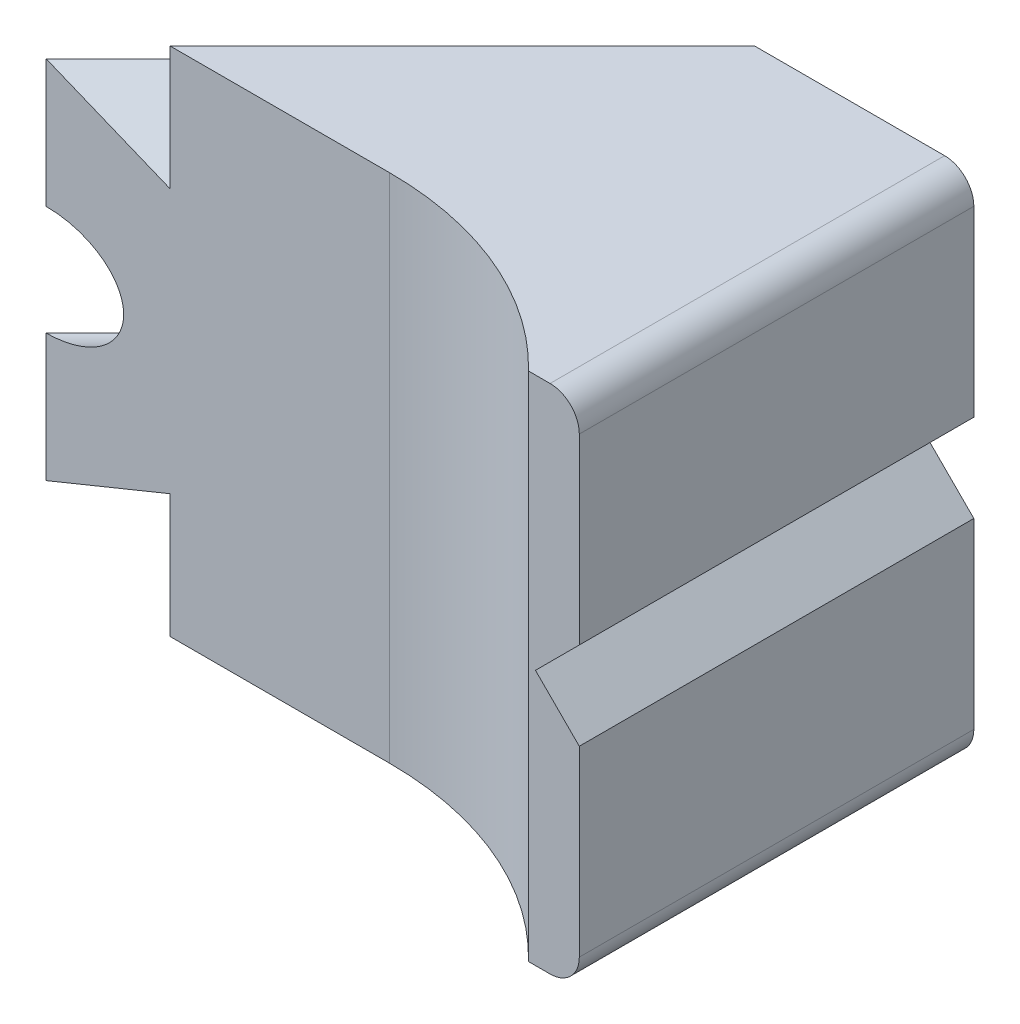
ISO-10303-21;
HEADER;
FILE_DESCRIPTION(('STEP AP214'),'2;1');
FILE_NAME('part.step','',(''),(''),'','','');
FILE_SCHEMA(('AUTOMOTIVE_DESIGN { 1 0 10303 214 1 1 1 1 }'));
ENDSEC;
DATA;
#1=APPLICATION_CONTEXT('core data for automotive mechanical design processes');
#2=APPLICATION_PROTOCOL_DEFINITION('international standard','automotive_design',2000,#1);
#3=PRODUCT_CONTEXT('',#1,'mechanical');
#4=PRODUCT('Part','Part','',(#3));
#5=PRODUCT_RELATED_PRODUCT_CATEGORY('part','',(#4));
#6=PRODUCT_DEFINITION_FORMATION('','',#4);
#7=PRODUCT_DEFINITION_CONTEXT('part definition',#1,'design');
#8=PRODUCT_DEFINITION('design','',#6,#7);
#9=PRODUCT_DEFINITION_SHAPE('','',#8);
#10=(LENGTH_UNIT() NAMED_UNIT(*) SI_UNIT(.MILLI.,.METRE.));
#11=(NAMED_UNIT(*) PLANE_ANGLE_UNIT() SI_UNIT($,.RADIAN.));
#12=(NAMED_UNIT(*) SI_UNIT($,.STERADIAN.) SOLID_ANGLE_UNIT());
#13=UNCERTAINTY_MEASURE_WITH_UNIT(LENGTH_MEASURE(1.E-05),#10,'distance_accuracy_value','');
#14=(GEOMETRIC_REPRESENTATION_CONTEXT(3) GLOBAL_UNCERTAINTY_ASSIGNED_CONTEXT((#13)) GLOBAL_UNIT_ASSIGNED_CONTEXT((#10,
#11,#12)) REPRESENTATION_CONTEXT('',''));
#15=CARTESIAN_POINT('',(0.,0.,0.));
#16=DIRECTION('',(0.,0.,1.));
#17=DIRECTION('',(1.,0.,0.));
#18=AXIS2_PLACEMENT_3D('',#15,#16,#17);
#19=CARTESIAN_POINT('',(23.4852813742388,-17.5,27.));
#20=DIRECTION('',(1.,0.,0.));
#21=DIRECTION('',(0.,1.,0.));
#22=AXIS2_PLACEMENT_3D('',#19,#20,#21);
#23=PLANE('',#22);
#24=DIRECTION('',(0.,0.,1.));
#25=VECTOR('',#24,1.);
#26=CARTESIAN_POINT('',(23.4852813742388,3.,0.));
#27=LINE('',#26,#25);
#28=CARTESIAN_POINT('',(23.4852813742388,3.,0.));
#29=VERTEX_POINT('',#28);
#30=CARTESIAN_POINT('',(23.4852813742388,3.,27.));
#31=VERTEX_POINT('',#30);
#32=EDGE_CURVE('E332',#29,#31,#27,.T.);
#33=ORIENTED_EDGE('',*,*,#32,.F.);
#34=DIRECTION('',(0.,1.,0.));
#35=VECTOR('',#34,1.);
#36=CARTESIAN_POINT('',(23.4852813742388,-17.5,0.));
#37=LINE('',#36,#35);
#38=CARTESIAN_POINT('',(23.4852813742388,15.5,0.));
#39=VERTEX_POINT('',#38);
#40=EDGE_CURVE('E346',#29,#39,#37,.T.);
#41=ORIENTED_EDGE('',*,*,#40,.T.);
#42=DIRECTION('',(0.,0.,1.));
#43=VECTOR('',#42,1.);
#44=CARTESIAN_POINT('',(23.4852813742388,15.5,27.));
#45=LINE('',#44,#43);
#46=CARTESIAN_POINT('',(23.4852813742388,15.5,27.));
#47=VERTEX_POINT('',#46);
#48=EDGE_CURVE('E362',#39,#47,#45,.T.);
#49=ORIENTED_EDGE('',*,*,#48,.T.);
#50=DIRECTION('',(0.,-1.,0.));
#51=VECTOR('',#50,1.);
#52=CARTESIAN_POINT('',(23.4852813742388,-17.5,27.));
#53=LINE('',#52,#51);
#54=EDGE_CURVE('E351',#47,#31,#53,.T.);
#55=ORIENTED_EDGE('',*,*,#54,.T.);
#56=EDGE_LOOP('',(#33,#41,#49,#55));
#57=FACE_BOUND('',#56,.T.);
#58=ADVANCED_FACE('F14',(#57),#23,.T.);
#59=DIRECTION('',(0.,0.,1.));
#60=VECTOR('',#59,1.);
#61=CARTESIAN_POINT('',(23.4852813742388,-3.,0.));
#62=LINE('',#61,#60);
#63=CARTESIAN_POINT('',(23.4852813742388,-3.,0.));
#64=VERTEX_POINT('',#63);
#65=CARTESIAN_POINT('',(23.4852813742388,-3.,27.));
#66=VERTEX_POINT('',#65);
#67=EDGE_CURVE('E333',#64,#66,#62,.T.);
#68=ORIENTED_EDGE('',*,*,#67,.T.);
#69=CARTESIAN_POINT('',(23.4852813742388,-15.5,27.));
#70=VERTEX_POINT('',#69);
#71=EDGE_CURVE('E350',#66,#70,#53,.T.);
#72=ORIENTED_EDGE('',*,*,#71,.T.);
#73=DIRECTION('',(0.,0.,-1.));
#74=VECTOR('',#73,1.);
#75=CARTESIAN_POINT('',(23.4852813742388,-15.5,0.));
#76=LINE('',#75,#74);
#77=CARTESIAN_POINT('',(23.4852813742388,-15.5,0.));
#78=VERTEX_POINT('',#77);
#79=EDGE_CURVE('E365',#70,#78,#76,.T.);
#80=ORIENTED_EDGE('',*,*,#79,.T.);
#81=EDGE_CURVE('E347',#78,#64,#37,.T.);
#82=ORIENTED_EDGE('',*,*,#81,.T.);
#83=EDGE_LOOP('',(#68,#72,#80,#82));
#84=FACE_BOUND('',#83,.T.);
#85=ADVANCED_FACE('F388',(#84),#23,.T.);
#86=CARTESIAN_POINT('',(20.4852813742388,0.,0.));
#87=DIRECTION('',(-0.707106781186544,-0.707106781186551,0.));
#88=DIRECTION('',(0.707106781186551,-0.707106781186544,0.));
#89=AXIS2_PLACEMENT_3D('',#86,#87,#88);
#90=PLANE('',#89);
#91=DIRECTION('',(0.707106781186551,-0.707106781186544,0.));
#92=VECTOR('',#91,1.);
#93=CARTESIAN_POINT('',(20.4852813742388,0.,27.));
#94=LINE('',#93,#92);
#95=CARTESIAN_POINT('',(20.4852813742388,0.,27.));
#96=VERTEX_POINT('',#95);
#97=EDGE_CURVE('E326',#96,#66,#94,.T.);
#98=ORIENTED_EDGE('',*,*,#97,.T.);
#99=ORIENTED_EDGE('',*,*,#67,.F.);
#100=DIRECTION('',(0.707106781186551,-0.707106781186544,0.));
#101=VECTOR('',#100,1.);
#102=CARTESIAN_POINT('',(20.4852813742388,0.,0.));
#103=LINE('',#102,#101);
#104=CARTESIAN_POINT('',(20.4852813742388,0.,0.));
#105=VERTEX_POINT('',#104);
#106=EDGE_CURVE('E329',#105,#64,#103,.T.);
#107=ORIENTED_EDGE('',*,*,#106,.F.);
#108=DIRECTION('',(0.,0.,1.));
#109=VECTOR('',#108,1.);
#110=CARTESIAN_POINT('',(20.4852813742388,0.,0.));
#111=LINE('',#110,#109);
#112=EDGE_CURVE('E337',#105,#96,#111,.T.);
#113=ORIENTED_EDGE('',*,*,#112,.T.);
#114=EDGE_LOOP('',(#98,#99,#107,#113));
#115=FACE_BOUND('',#114,.T.);
#116=ADVANCED_FACE('F395',(#115),#90,.F.);
#117=CARTESIAN_POINT('',(23.4852813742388,3.,0.));
#118=DIRECTION('',(-0.707106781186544,0.707106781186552,0.));
#119=DIRECTION('',(-0.707106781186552,-0.707106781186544,0.));
#120=AXIS2_PLACEMENT_3D('',#117,#118,#119);
#121=PLANE('',#120);
#122=DIRECTION('',(-0.707106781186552,-0.707106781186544,0.));
#123=VECTOR('',#122,1.);
#124=CARTESIAN_POINT('',(23.4852813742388,3.,27.));
#125=LINE('',#124,#123);
#126=EDGE_CURVE('E323',#31,#96,#125,.T.);
#127=ORIENTED_EDGE('',*,*,#126,.T.);
#128=ORIENTED_EDGE('',*,*,#112,.F.);
#129=DIRECTION('',(-0.707106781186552,-0.707106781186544,0.));
#130=VECTOR('',#129,1.);
#131=CARTESIAN_POINT('',(23.4852813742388,3.,0.));
#132=LINE('',#131,#130);
#133=EDGE_CURVE('E29',#29,#105,#132,.T.);
#134=ORIENTED_EDGE('',*,*,#133,.F.);
#135=ORIENTED_EDGE('',*,*,#32,.T.);
#136=EDGE_LOOP('',(#127,#128,#134,#135));
#137=FACE_BOUND('',#136,.T.);
#138=ADVANCED_FACE('F475',(#137),#121,.F.);
#139=CARTESIAN_POINT('',(21.4852813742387,-15.5,27.));
#140=DIRECTION('',(0.,0.,1.));
#141=DIRECTION('',(0.,-1.,0.));
#142=AXIS2_PLACEMENT_3D('',#139,#140,#141);
#143=CYLINDRICAL_SURFACE('',#142,2.);
#144=CARTESIAN_POINT('',(21.4852813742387,-15.5,27.));
#145=DIRECTION('',(0.,0.,-1.));
#146=DIRECTION('',(-1.,0.,0.));
#147=AXIS2_PLACEMENT_3D('',#144,#145,#146);
#148=CIRCLE('',#147,2.);
#149=CARTESIAN_POINT('',(21.4852813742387,-17.5,27.));
#150=VERTEX_POINT('',#149);
#151=EDGE_CURVE('E22',#150,#70,#148,.F.);
#152=ORIENTED_EDGE('',*,*,#151,.F.);
#153=DIRECTION('',(0.,0.,-1.));
#154=VECTOR('',#153,1.);
#155=CARTESIAN_POINT('',(21.4852813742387,-17.5,27.));
#156=LINE('',#155,#154);
#157=CARTESIAN_POINT('',(21.4852813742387,-17.5,0.));
#158=VERTEX_POINT('',#157);
#159=EDGE_CURVE('E373',#158,#150,#156,.F.);
#160=ORIENTED_EDGE('',*,*,#159,.F.);
#161=CARTESIAN_POINT('',(21.4852813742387,-15.5,0.));
#162=DIRECTION('',(0.,0.,1.));
#163=DIRECTION('',(0.,-1.,0.));
#164=AXIS2_PLACEMENT_3D('',#161,#162,#163);
#165=CIRCLE('',#164,2.);
#166=EDGE_CURVE('E371',#78,#158,#165,.F.);
#167=ORIENTED_EDGE('',*,*,#166,.F.);
#168=ORIENTED_EDGE('',*,*,#79,.F.);
#169=EDGE_LOOP('',(#152,#160,#167,#168));
#170=FACE_BOUND('',#169,.T.);
#171=ADVANCED_FACE('F385',(#170),#143,.T.);
#172=CARTESIAN_POINT('',(21.4852813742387,15.5,27.));
#173=DIRECTION('',(0.,0.,-1.));
#174=DIRECTION('',(0.,1.,0.));
#175=AXIS2_PLACEMENT_3D('',#172,#173,#174);
#176=CYLINDRICAL_SURFACE('',#175,2.);
#177=CARTESIAN_POINT('',(21.4852813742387,15.5,0.));
#178=DIRECTION('',(0.,0.,1.));
#179=DIRECTION('',(0.,-1.,0.));
#180=AXIS2_PLACEMENT_3D('',#177,#178,#179);
#181=CIRCLE('',#180,2.);
#182=CARTESIAN_POINT('',(21.4852813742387,17.5,0.));
#183=VERTEX_POINT('',#182);
#184=EDGE_CURVE('E368',#183,#39,#181,.F.);
#185=ORIENTED_EDGE('',*,*,#184,.F.);
#186=DIRECTION('',(0.,0.,1.));
#187=VECTOR('',#186,1.);
#188=CARTESIAN_POINT('',(21.4852813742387,17.5,0.));
#189=LINE('',#188,#187);
#190=CARTESIAN_POINT('',(21.4852813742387,17.5,27.));
#191=VERTEX_POINT('',#190);
#192=EDGE_CURVE('E9',#191,#183,#189,.F.);
#193=ORIENTED_EDGE('',*,*,#192,.F.);
#194=CARTESIAN_POINT('',(21.4852813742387,15.5,27.));
#195=DIRECTION('',(0.,0.,-1.));
#196=DIRECTION('',(-1.,0.,0.));
#197=AXIS2_PLACEMENT_3D('',#194,#195,#196);
#198=CIRCLE('',#197,2.);
#199=EDGE_CURVE('E37',#47,#191,#198,.F.);
#200=ORIENTED_EDGE('',*,*,#199,.F.);
#201=ORIENTED_EDGE('',*,*,#48,.F.);
#202=EDGE_LOOP('',(#185,#193,#200,#201));
#203=FACE_BOUND('',#202,.T.);
#204=ADVANCED_FACE('F401',(#203),#176,.T.);
#205=CARTESIAN_POINT('',(23.4852813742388,-17.5,27.));
#206=DIRECTION('',(0.,0.,-1.));
#207=DIRECTION('',(-1.,0.,0.));
#208=AXIS2_PLACEMENT_3D('',#205,#206,#207);
#209=PLANE('',#208);
#210=ORIENTED_EDGE('',*,*,#71,.F.);
#211=ORIENTED_EDGE('',*,*,#97,.F.);
#212=ORIENTED_EDGE('',*,*,#126,.F.);
#213=ORIENTED_EDGE('',*,*,#54,.F.);
#214=ORIENTED_EDGE('',*,*,#199,.T.);
#215=DIRECTION('',(-1.,0.,0.));
#216=VECTOR('',#215,1.);
#217=CARTESIAN_POINT('',(23.4852813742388,17.5,27.));
#218=LINE('',#217,#216);
#219=CARTESIAN_POINT('',(20.0079930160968,17.5,27.));
#220=VERTEX_POINT('',#219);
#221=EDGE_CURVE('E356',#191,#220,#218,.T.);
#222=ORIENTED_EDGE('',*,*,#221,.T.);
#223=DIRECTION('',(0.,1.,0.));
#224=VECTOR('',#223,1.);
#225=CARTESIAN_POINT('',(20.0079930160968,-17.5,27.));
#226=LINE('',#225,#224);
#227=CARTESIAN_POINT('',(20.0079930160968,-17.5,27.));
#228=VERTEX_POINT('',#227);
#229=EDGE_CURVE('E343',#228,#220,#226,.T.);
#230=ORIENTED_EDGE('',*,*,#229,.F.);
#231=DIRECTION('',(-1.,0.,0.));
#232=VECTOR('',#231,1.);
#233=CARTESIAN_POINT('',(23.4852813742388,-17.5,27.));
#234=LINE('',#233,#232);
#235=EDGE_CURVE('E354',#150,#228,#234,.T.);
#236=ORIENTED_EDGE('',*,*,#235,.F.);
#237=ORIENTED_EDGE('',*,*,#151,.T.);
#238=EDGE_LOOP('',(#210,#211,#212,#213,#214,#222,#230,#236,#237));
#239=FACE_BOUND('',#238,.T.);
#240=ADVANCED_FACE('F380',(#239),#209,.F.);
#241=CARTESIAN_POINT('',(3.48528137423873,-17.5,43.));
#242=DIRECTION('',(0.,1.,0.));
#243=DIRECTION('',(-1.,0.,0.));
#244=AXIS2_PLACEMENT_3D('',#241,#242,#243);
#245=CYLINDRICAL_SURFACE('',#244,23.);
#246=CARTESIAN_POINT('',(3.48528137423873,17.5,43.));
#247=DIRECTION('',(0.,1.,0.));
#248=DIRECTION('',(-1.,0.,0.));
#249=AXIS2_PLACEMENT_3D('',#246,#247,#248);
#250=CIRCLE('',#249,23.);
#251=CARTESIAN_POINT('',(3.48528137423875,17.5,20.));
#252=VERTEX_POINT('',#251);
#253=EDGE_CURVE('E336',#220,#252,#250,.T.);
#254=ORIENTED_EDGE('',*,*,#253,.T.);
#255=DIRECTION('',(0.,-1.,0.));
#256=VECTOR('',#255,1.);
#257=CARTESIAN_POINT('',(3.48528137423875,27.7583381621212,20.));
#258=LINE('',#257,#256);
#259=CARTESIAN_POINT('',(3.48528137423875,-17.5,20.));
#260=VERTEX_POINT('',#259);
#261=EDGE_CURVE('E246',#252,#260,#258,.T.);
#262=ORIENTED_EDGE('',*,*,#261,.T.);
#263=CARTESIAN_POINT('',(3.48528137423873,-17.5,43.));
#264=DIRECTION('',(0.,1.,0.));
#265=DIRECTION('',(-1.,0.,0.));
#266=AXIS2_PLACEMENT_3D('',#263,#264,#265);
#267=CIRCLE('',#266,23.);
#268=EDGE_CURVE('E341',#228,#260,#267,.T.);
#269=ORIENTED_EDGE('',*,*,#268,.F.);
#270=ORIENTED_EDGE('',*,*,#229,.T.);
#271=EDGE_LOOP('',(#254,#262,#269,#270));
#272=FACE_BOUND('',#271,.T.);
#273=ADVANCED_FACE('F442',(#272),#245,.F.);
#274=CARTESIAN_POINT('',(23.4852813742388,17.5,27.));
#275=DIRECTION('',(0.,-1.,0.));
#276=DIRECTION('',(0.,0.,-1.));
#277=AXIS2_PLACEMENT_3D('',#274,#275,#276);
#278=PLANE('',#277);
#279=ORIENTED_EDGE('',*,*,#221,.F.);
#280=ORIENTED_EDGE('',*,*,#192,.T.);
#281=DIRECTION('',(-1.,0.,0.));
#282=VECTOR('',#281,1.);
#283=CARTESIAN_POINT('',(23.4852813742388,17.5,0.));
#284=LINE('',#283,#282);
#285=CARTESIAN_POINT('',(8.48528137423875,17.5,0.));
#286=VERTEX_POINT('',#285);
#287=EDGE_CURVE('E358',#183,#286,#284,.T.);
#288=ORIENTED_EDGE('',*,*,#287,.T.);
#289=DIRECTION('',(0.707106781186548,0.,-0.707106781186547));
#290=VECTOR('',#289,1.);
#291=CARTESIAN_POINT('',(1.74264068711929,17.5,6.74264068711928));
#292=LINE('',#291,#290);
#293=CARTESIAN_POINT('',(-11.5147186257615,17.5,20.));
#294=VERTEX_POINT('',#293);
#295=EDGE_CURVE('E311',#294,#286,#292,.T.);
#296=ORIENTED_EDGE('',*,*,#295,.F.);
#297=DIRECTION('',(1.,0.,0.));
#298=VECTOR('',#297,1.);
#299=CARTESIAN_POINT('',(15.,17.5,20.));
#300=LINE('',#299,#298);
#301=EDGE_CURVE('E293',#294,#252,#300,.T.);
#302=ORIENTED_EDGE('',*,*,#301,.T.);
#303=ORIENTED_EDGE('',*,*,#253,.F.);
#304=EDGE_LOOP('',(#279,#280,#288,#296,#302,#303));
#305=FACE_BOUND('',#304,.T.);
#306=ADVANCED_FACE('F405',(#305),#278,.F.);
#307=CARTESIAN_POINT('',(23.4852813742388,-17.5,27.));
#308=DIRECTION('',(0.,1.,0.));
#309=DIRECTION('',(0.,0.,1.));
#310=AXIS2_PLACEMENT_3D('',#307,#308,#309);
#311=PLANE('',#310);
#312=DIRECTION('',(-1.,0.,0.));
#313=VECTOR('',#312,1.);
#314=CARTESIAN_POINT('',(23.4852813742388,-17.5,0.));
#315=LINE('',#314,#313);
#316=CARTESIAN_POINT('',(8.48528137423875,-17.5,0.));
#317=VERTEX_POINT('',#316);
#318=EDGE_CURVE('E360',#158,#317,#315,.T.);
#319=ORIENTED_EDGE('',*,*,#318,.F.);
#320=ORIENTED_EDGE('',*,*,#159,.T.);
#321=ORIENTED_EDGE('',*,*,#235,.T.);
#322=ORIENTED_EDGE('',*,*,#268,.T.);
#323=DIRECTION('',(1.,0.,0.));
#324=VECTOR('',#323,1.);
#325=CARTESIAN_POINT('',(15.,-17.5,20.));
#326=LINE('',#325,#324);
#327=CARTESIAN_POINT('',(-11.5147186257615,-17.5,20.));
#328=VERTEX_POINT('',#327);
#329=EDGE_CURVE('E290',#328,#260,#326,.T.);
#330=ORIENTED_EDGE('',*,*,#329,.F.);
#331=DIRECTION('',(0.707106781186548,0.,-0.707106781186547));
#332=VECTOR('',#331,1.);
#333=CARTESIAN_POINT('',(1.74264068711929,-17.5,6.74264068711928));
#334=LINE('',#333,#332);
#335=EDGE_CURVE('E317',#328,#317,#334,.T.);
#336=ORIENTED_EDGE('',*,*,#335,.T.);
#337=EDGE_LOOP('',(#319,#320,#321,#322,#330,#336));
#338=FACE_BOUND('',#337,.T.);
#339=ADVANCED_FACE('F16',(#338),#311,.F.);
#340=CARTESIAN_POINT('',(23.4852813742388,-17.5,0.));
#341=DIRECTION('',(0.,0.,1.));
#342=DIRECTION('',(0.,-1.,0.));
#343=AXIS2_PLACEMENT_3D('',#340,#341,#342);
#344=PLANE('',#343);
#345=ORIENTED_EDGE('',*,*,#133,.T.);
#346=ORIENTED_EDGE('',*,*,#106,.T.);
#347=ORIENTED_EDGE('',*,*,#81,.F.);
#348=ORIENTED_EDGE('',*,*,#166,.T.);
#349=ORIENTED_EDGE('',*,*,#318,.T.);
#350=DIRECTION('',(0.,1.,0.));
#351=VECTOR('',#350,1.);
#352=CARTESIAN_POINT('',(8.48528137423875,17.5,0.));
#353=LINE('',#352,#351);
#354=CARTESIAN_POINT('',(8.48528137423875,-9.0358983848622,0.));
#355=VERTEX_POINT('',#354);
#356=EDGE_CURVE('E253',#317,#355,#353,.T.);
#357=ORIENTED_EDGE('',*,*,#356,.T.);
#358=DIRECTION('',(-0.92582009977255,-0.377964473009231,0.));
#359=VECTOR('',#358,1.);
#360=CARTESIAN_POINT('',(-6.64504395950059,-15.2128278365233,0.));
#361=LINE('',#360,#359);
#362=CARTESIAN_POINT('',(0.,-12.5,0.));
#363=VERTEX_POINT('',#362);
#364=EDGE_CURVE('E320',#355,#363,#361,.T.);
#365=ORIENTED_EDGE('',*,*,#364,.T.);
#366=DIRECTION('',(0.,1.,0.));
#367=VECTOR('',#366,1.);
#368=CARTESIAN_POINT('',(1.49186218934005E-13,-17.5,0.));
#369=LINE('',#368,#367);
#370=CARTESIAN_POINT('',(0.,12.5,0.));
#371=VERTEX_POINT('',#370);
#372=EDGE_CURVE('E288',#363,#371,#369,.T.);
#373=ORIENTED_EDGE('',*,*,#372,.T.);
#374=DIRECTION('',(0.92582009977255,-0.377964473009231,0.));
#375=VECTOR('',#374,1.);
#376=CARTESIAN_POINT('',(-18.8924926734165,20.2128278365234,0.));
#377=LINE('',#376,#375);
#378=CARTESIAN_POINT('',(8.48528137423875,9.0358983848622,0.));
#379=VERTEX_POINT('',#378);
#380=EDGE_CURVE('E314',#371,#379,#377,.T.);
#381=ORIENTED_EDGE('',*,*,#380,.T.);
#382=DIRECTION('',(0.,1.,0.));
#383=VECTOR('',#382,1.);
#384=CARTESIAN_POINT('',(8.48528137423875,17.5,0.));
#385=LINE('',#384,#383);
#386=EDGE_CURVE('E268',#379,#286,#385,.T.);
#387=ORIENTED_EDGE('',*,*,#386,.T.);
#388=ORIENTED_EDGE('',*,*,#287,.F.);
#389=ORIENTED_EDGE('',*,*,#184,.T.);
#390=ORIENTED_EDGE('',*,*,#40,.F.);
#391=EDGE_LOOP('',(#345,#346,#347,#348,#349,#357,#365,#373,#381,#387,#388,#389,#390));
#392=FACE_BOUND('',#391,.T.);
#393=ADVANCED_FACE('F390',(#392),#344,.F.);
#394=CARTESIAN_POINT('',(-10.0644155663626,3.42066270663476,9.42948777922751));
#395=DIRECTION('',(0.707106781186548,0.,-0.707106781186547));
#396=DIRECTION('',(0.270856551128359,0.923728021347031,0.270856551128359));
#397=AXIS2_PLACEMENT_3D('',#394,#395,#396);
#398=PLANE('',#397);
#399=DIRECTION('',(-0.561155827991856,-0.6084474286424,-0.561155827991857));
#400=VECTOR('',#399,1.);
#401=CARTESIAN_POINT('',(-10.0644155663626,3.42066270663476,9.42948777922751));
#402=LINE('',#401,#400);
#403=CARTESIAN_POINT('',(-10.0644155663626,3.42066270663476,9.42948777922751));
#404=VERTEX_POINT('',#403);
#405=CARTESIAN_POINT('',(-12.0004031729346,1.32151907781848,7.4935001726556));
#406=VERTEX_POINT('',#405);
#407=EDGE_CURVE('E217',#404,#406,#402,.T.);
#408=ORIENTED_EDGE('',*,*,#407,.T.);
#409=DIRECTION('',(0.0920185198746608,-0.991496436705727,0.0920185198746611));
#410=VECTOR('',#409,1.);
#411=CARTESIAN_POINT('',(-12.0004031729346,1.32151907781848,7.4935001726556));
#412=LINE('',#411,#410);
#413=CARTESIAN_POINT('',(-11.682939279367,-2.09914362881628,7.81096406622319));
#414=VERTEX_POINT('',#413);
#415=EDGE_CURVE('E220',#406,#414,#412,.T.);
#416=ORIENTED_EDGE('',*,*,#415,.T.);
#417=DIRECTION('',(0.653174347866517,-0.383049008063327,0.653174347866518));
#418=VECTOR('',#417,1.);
#419=CARTESIAN_POINT('',(-11.682939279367,-2.09914362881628,7.81096406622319));
#420=LINE('',#419,#418);
#421=CARTESIAN_POINT('',(-9.4294877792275,-3.42066270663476,10.0644155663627));
#422=VERTEX_POINT('',#421);
#423=EDGE_CURVE('E187',#414,#422,#420,.T.);
#424=ORIENTED_EDGE('',*,*,#423,.T.);
#425=DIRECTION('',(0.561155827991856,0.6084474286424,0.561155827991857));
#426=VECTOR('',#425,1.);
#427=CARTESIAN_POINT('',(-9.4294877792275,-3.42066270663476,10.0644155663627));
#428=LINE('',#427,#426);
#429=CARTESIAN_POINT('',(-7.4935001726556,-1.32151907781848,12.0004031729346));
#430=VERTEX_POINT('',#429);
#431=EDGE_CURVE('E223',#422,#430,#428,.T.);
#432=ORIENTED_EDGE('',*,*,#431,.T.);
#433=DIRECTION('',(-0.0920185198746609,0.991496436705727,-0.0920185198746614));
#434=VECTOR('',#433,1.);
#435=CARTESIAN_POINT('',(-7.4935001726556,-1.32151907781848,12.0004031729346));
#436=LINE('',#435,#434);
#437=CARTESIAN_POINT('',(-7.81096406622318,2.09914362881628,11.682939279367));
#438=VERTEX_POINT('',#437);
#439=EDGE_CURVE('E226',#430,#438,#436,.T.);
#440=ORIENTED_EDGE('',*,*,#439,.T.);
#441=DIRECTION('',(-0.653174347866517,0.383049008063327,-0.653174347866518));
#442=VECTOR('',#441,1.);
#443=CARTESIAN_POINT('',(-7.81096406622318,2.09914362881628,11.682939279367));
#444=LINE('',#443,#442);
#445=EDGE_CURVE('E229',#438,#404,#444,.T.);
#446=ORIENTED_EDGE('',*,*,#445,.T.);
#447=EDGE_LOOP('',(#408,#416,#424,#432,#440,#446));
#448=FACE_BOUND('',#447,.T.);
#449=ADVANCED_FACE('F569',(#448),#398,.F.);
#450=CARTESIAN_POINT('',(-12.0004031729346,1.32151907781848,7.4935001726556));
#451=DIRECTION('',(-0.701093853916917,-0.130133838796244,-0.701093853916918));
#452=DIRECTION('',(0.0920185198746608,-0.991496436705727,0.0920185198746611));
#453=AXIS2_PLACEMENT_3D('',#450,#451,#452);
#454=PLANE('',#453);
#455=DIRECTION('',(0.0920185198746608,-0.991496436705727,0.0920185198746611));
#456=VECTOR('',#455,1.);
#457=CARTESIAN_POINT('',(-16.2430438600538,1.32151907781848,11.7361408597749));
#458=LINE('',#457,#456);
#459=CARTESIAN_POINT('',(-16.2430438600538,1.32151907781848,11.7361408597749));
#460=VERTEX_POINT('',#459);
#461=CARTESIAN_POINT('',(-15.9255799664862,-2.09914362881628,12.0536047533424));
#462=VERTEX_POINT('',#461);
#463=EDGE_CURVE('E196',#460,#462,#458,.T.);
#464=ORIENTED_EDGE('',*,*,#463,.T.);
#465=DIRECTION('',(-0.707106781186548,0.,0.707106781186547));
#466=VECTOR('',#465,1.);
#467=CARTESIAN_POINT('',(-11.682939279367,-2.09914362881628,7.81096406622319));
#468=LINE('',#467,#466);
#469=EDGE_CURVE('E180',#414,#462,#468,.T.);
#470=ORIENTED_EDGE('',*,*,#469,.F.);
#471=ORIENTED_EDGE('',*,*,#415,.F.);
#472=DIRECTION('',(-0.707106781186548,0.,0.707106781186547));
#473=VECTOR('',#472,1.);
#474=CARTESIAN_POINT('',(-12.0004031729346,1.32151907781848,7.4935001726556));
#475=LINE('',#474,#473);
#476=EDGE_CURVE('E192',#406,#460,#475,.T.);
#477=ORIENTED_EDGE('',*,*,#476,.T.);
#478=EDGE_LOOP('',(#464,#470,#471,#477));
#479=FACE_BOUND('',#478,.T.);
#480=ADVANCED_FACE('F197',(#479),#454,.F.);
#481=CARTESIAN_POINT('',(-11.682939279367,-2.09914362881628,7.81096406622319));
#482=DIRECTION('',(-0.270856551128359,-0.923728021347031,-0.270856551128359));
#483=DIRECTION('',(0.653174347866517,-0.383049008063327,0.653174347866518));
#484=AXIS2_PLACEMENT_3D('',#481,#482,#483);
#485=PLANE('',#484);
#486=DIRECTION('',(0.653174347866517,-0.383049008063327,0.653174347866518));
#487=VECTOR('',#486,1.);
#488=CARTESIAN_POINT('',(-15.9255799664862,-2.09914362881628,12.0536047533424));
#489=LINE('',#488,#487);
#490=CARTESIAN_POINT('',(-13.6721284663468,-3.42066270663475,14.307056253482));
#491=VERTEX_POINT('',#490);
#492=EDGE_CURVE('E184',#462,#491,#489,.T.);
#493=ORIENTED_EDGE('',*,*,#492,.T.);
#494=DIRECTION('',(-0.707106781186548,0.,0.707106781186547));
#495=VECTOR('',#494,1.);
#496=CARTESIAN_POINT('',(-9.4294877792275,-3.42066270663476,10.0644155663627));
#497=LINE('',#496,#495);
#498=EDGE_CURVE('E191',#422,#491,#497,.T.);
#499=ORIENTED_EDGE('',*,*,#498,.F.);
#500=ORIENTED_EDGE('',*,*,#423,.F.);
#501=ORIENTED_EDGE('',*,*,#469,.T.);
#502=EDGE_LOOP('',(#493,#499,#500,#501));
#503=FACE_BOUND('',#502,.T.);
#504=ADVANCED_FACE('F182',(#503),#485,.F.);
#505=CARTESIAN_POINT('',(-9.4294877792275,-3.42066270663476,10.0644155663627));
#506=DIRECTION('',(0.430237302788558,-0.793594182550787,0.430237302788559));
#507=DIRECTION('',(0.561155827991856,0.6084474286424,0.561155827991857));
#508=AXIS2_PLACEMENT_3D('',#505,#506,#507);
#509=PLANE('',#508);
#510=DIRECTION('',(0.561155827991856,0.6084474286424,0.561155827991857));
#511=VECTOR('',#510,1.);
#512=CARTESIAN_POINT('',(-13.6721284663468,-3.42066270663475,14.307056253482));
#513=LINE('',#512,#511);
#514=CARTESIAN_POINT('',(-11.7361408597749,-1.32151907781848,16.2430438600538));
#515=VERTEX_POINT('',#514);
#516=EDGE_CURVE('E206',#491,#515,#513,.T.);
#517=ORIENTED_EDGE('',*,*,#516,.T.);
#518=DIRECTION('',(-0.707106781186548,0.,0.707106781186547));
#519=VECTOR('',#518,1.);
#520=CARTESIAN_POINT('',(-7.4935001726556,-1.32151907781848,12.0004031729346));
#521=LINE('',#520,#519);
#522=EDGE_CURVE('E237',#430,#515,#521,.T.);
#523=ORIENTED_EDGE('',*,*,#522,.F.);
#524=ORIENTED_EDGE('',*,*,#431,.F.);
#525=ORIENTED_EDGE('',*,*,#498,.T.);
#526=EDGE_LOOP('',(#517,#523,#524,#525));
#527=FACE_BOUND('',#526,.T.);
#528=ADVANCED_FACE('F629',(#527),#509,.F.);
#529=CARTESIAN_POINT('',(-7.4935001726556,-1.32151907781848,12.0004031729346));
#530=DIRECTION('',(0.701093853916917,0.130133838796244,0.701093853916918));
#531=DIRECTION('',(-0.0920185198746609,0.991496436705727,-0.0920185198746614));
#532=AXIS2_PLACEMENT_3D('',#529,#530,#531);
#533=PLANE('',#532);
#534=DIRECTION('',(-0.0920185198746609,0.991496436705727,-0.0920185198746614));
#535=VECTOR('',#534,1.);
#536=CARTESIAN_POINT('',(-11.7361408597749,-1.32151907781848,16.2430438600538));
#537=LINE('',#536,#535);
#538=CARTESIAN_POINT('',(-12.0536047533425,2.09914362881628,15.9255799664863));
#539=VERTEX_POINT('',#538);
#540=EDGE_CURVE('E208',#515,#539,#537,.T.);
#541=ORIENTED_EDGE('',*,*,#540,.T.);
#542=DIRECTION('',(-0.707106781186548,0.,0.707106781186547));
#543=VECTOR('',#542,1.);
#544=CARTESIAN_POINT('',(-7.81096406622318,2.09914362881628,11.682939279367));
#545=LINE('',#544,#543);
#546=EDGE_CURVE('E235',#438,#539,#545,.T.);
#547=ORIENTED_EDGE('',*,*,#546,.F.);
#548=ORIENTED_EDGE('',*,*,#439,.F.);
#549=ORIENTED_EDGE('',*,*,#522,.T.);
#550=EDGE_LOOP('',(#541,#547,#548,#549));
#551=FACE_BOUND('',#550,.T.);
#552=ADVANCED_FACE('F619',(#551),#533,.F.);
#553=CARTESIAN_POINT('',(-7.81096406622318,2.09914362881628,11.682939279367));
#554=DIRECTION('',(0.270856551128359,0.923728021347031,0.270856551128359));
#555=DIRECTION('',(-0.707106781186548,0.,0.707106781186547));
#556=AXIS2_PLACEMENT_3D('',#553,#554,#555);
#557=PLANE('',#556);
#558=DIRECTION('',(-0.653174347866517,0.383049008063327,-0.653174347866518));
#559=VECTOR('',#558,1.);
#560=CARTESIAN_POINT('',(-12.0536047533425,2.09914362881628,15.9255799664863));
#561=LINE('',#560,#559);
#562=CARTESIAN_POINT('',(-14.3070562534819,3.42066270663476,13.6721284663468));
#563=VERTEX_POINT('',#562);
#564=EDGE_CURVE('E214',#539,#563,#561,.T.);
#565=ORIENTED_EDGE('',*,*,#564,.T.);
#566=DIRECTION('',(-0.707106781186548,0.,0.707106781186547));
#567=VECTOR('',#566,1.);
#568=CARTESIAN_POINT('',(-10.0644155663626,3.42066270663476,9.42948777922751));
#569=LINE('',#568,#567);
#570=EDGE_CURVE('E232',#404,#563,#569,.T.);
#571=ORIENTED_EDGE('',*,*,#570,.F.);
#572=ORIENTED_EDGE('',*,*,#445,.F.);
#573=ORIENTED_EDGE('',*,*,#546,.T.);
#574=EDGE_LOOP('',(#565,#571,#572,#573));
#575=FACE_BOUND('',#574,.T.);
#576=ADVANCED_FACE('F609',(#575),#557,.F.);
#577=CARTESIAN_POINT('',(-10.0644155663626,3.42066270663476,9.42948777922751));
#578=DIRECTION('',(-0.430237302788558,0.793594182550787,-0.430237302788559));
#579=DIRECTION('',(-0.561155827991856,-0.6084474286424,-0.561155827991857));
#580=AXIS2_PLACEMENT_3D('',#577,#578,#579);
#581=PLANE('',#580);
#582=DIRECTION('',(-0.561155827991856,-0.6084474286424,-0.561155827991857));
#583=VECTOR('',#582,1.);
#584=CARTESIAN_POINT('',(-14.3070562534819,3.42066270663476,13.6721284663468));
#585=LINE('',#584,#583);
#586=EDGE_CURVE('E200',#563,#460,#585,.T.);
#587=ORIENTED_EDGE('',*,*,#586,.T.);
#588=ORIENTED_EDGE('',*,*,#476,.F.);
#589=ORIENTED_EDGE('',*,*,#407,.F.);
#590=ORIENTED_EDGE('',*,*,#570,.T.);
#591=EDGE_LOOP('',(#587,#588,#589,#590));
#592=FACE_BOUND('',#591,.T.);
#593=ADVANCED_FACE('F592',(#592),#581,.F.);
#594=CARTESIAN_POINT('',(-4.0900974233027,0.,4.09009742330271));
#595=DIRECTION('',(-0.707106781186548,0.,0.707106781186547));
#596=DIRECTION('',(-0.270856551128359,-0.923728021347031,-0.270856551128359));
#597=AXIS2_PLACEMENT_3D('',#594,#595,#596);
#598=PLANE('',#597);
#599=CARTESIAN_POINT('',(-4.0900974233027,0.,4.09009742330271));
#600=DIRECTION('',(-0.707106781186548,0.,0.707106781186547));
#601=DIRECTION('',(-0.270856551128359,-0.923728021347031,-0.270856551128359));
#602=AXIS2_PLACEMENT_3D('',#599,#600,#601);
#603=CIRCLE('',#602,7.);
#604=CARTESIAN_POINT('',(-4.09009742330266,7.,4.09009742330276));
#605=VERTEX_POINT('',#604);
#606=CARTESIAN_POINT('',(-4.09009742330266,-7.,4.09009742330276));
#607=VERTEX_POINT('',#606);
#608=EDGE_CURVE('E234',#605,#607,#603,.T.);
#609=ORIENTED_EDGE('',*,*,#608,.F.);
#610=DIRECTION('',(0.,-1.,0.));
#611=VECTOR('',#610,1.);
#612=CARTESIAN_POINT('',(-4.09009742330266,-17.5,4.09009742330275));
#613=LINE('',#612,#611);
#614=EDGE_CURVE('E307',#605,#607,#613,.T.);
#615=ORIENTED_EDGE('',*,*,#614,.T.);
#616=EDGE_LOOP('',(#609,#615));
#617=FACE_BOUND('',#616,.T.);
#618=ADVANCED_FACE('F470',(#617),#598,.F.);
#619=CARTESIAN_POINT('',(-13.9895923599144,0.,13.9895923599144));
#620=DIRECTION('',(0.707106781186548,0.,-0.707106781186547));
#621=DIRECTION('',(0.270856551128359,0.923728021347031,0.270856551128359));
#622=AXIS2_PLACEMENT_3D('',#619,#620,#621);
#623=CYLINDRICAL_SURFACE('',#622,7.);
#624=DIRECTION('',(-0.707106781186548,0.,0.707106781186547));
#625=VECTOR('',#624,1.);
#626=CARTESIAN_POINT('',(-4.09009742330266,-7.,4.09009742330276));
#627=LINE('',#626,#625);
#628=CARTESIAN_POINT('',(-13.9895923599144,-7.,13.9895923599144));
#629=VERTEX_POINT('',#628);
#630=EDGE_CURVE('E304',#629,#607,#627,.F.);
#631=ORIENTED_EDGE('',*,*,#630,.F.);
#632=CARTESIAN_POINT('',(-13.9895923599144,0.,13.9895923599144));
#633=DIRECTION('',(-0.707106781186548,0.,0.707106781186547));
#634=DIRECTION('',(-0.270856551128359,-0.923728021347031,-0.270856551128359));
#635=AXIS2_PLACEMENT_3D('',#632,#633,#634);
#636=CIRCLE('',#635,7.);
#637=CARTESIAN_POINT('',(-13.9895923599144,7.,13.9895923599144));
#638=VERTEX_POINT('',#637);
#639=EDGE_CURVE('E243',#638,#629,#636,.T.);
#640=ORIENTED_EDGE('',*,*,#639,.F.);
#641=DIRECTION('',(-0.707106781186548,0.,0.707106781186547));
#642=VECTOR('',#641,1.);
#643=CARTESIAN_POINT('',(-4.09009742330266,7.,4.09009742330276));
#644=LINE('',#643,#642);
#645=EDGE_CURVE('E309',#605,#638,#644,.T.);
#646=ORIENTED_EDGE('',*,*,#645,.F.);
#647=ORIENTED_EDGE('',*,*,#608,.T.);
#648=EDGE_LOOP('',(#631,#640,#646,#647));
#649=FACE_BOUND('',#648,.T.);
#650=ADVANCED_FACE('F581',(#649),#623,.T.);
#651=CARTESIAN_POINT('',(-13.9895923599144,0.,13.9895923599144));
#652=DIRECTION('',(-0.707106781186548,0.,0.707106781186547));
#653=DIRECTION('',(-0.270856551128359,-0.923728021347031,-0.270856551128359));
#654=AXIS2_PLACEMENT_3D('',#651,#652,#653);
#655=PLANE('',#654);
#656=ORIENTED_EDGE('',*,*,#586,.F.);
#657=ORIENTED_EDGE('',*,*,#564,.F.);
#658=ORIENTED_EDGE('',*,*,#540,.F.);
#659=ORIENTED_EDGE('',*,*,#516,.F.);
#660=ORIENTED_EDGE('',*,*,#492,.F.);
#661=ORIENTED_EDGE('',*,*,#463,.F.);
#662=EDGE_LOOP('',(#656,#657,#658,#659,#660,#661));
#663=FACE_BOUND('',#662,.T.);
#664=DIRECTION('',(0.,-1.,0.));
#665=VECTOR('',#664,1.);
#666=CARTESIAN_POINT('',(-13.9895923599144,-17.5,13.9895923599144));
#667=LINE('',#666,#665);
#668=CARTESIAN_POINT('',(-13.9895923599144,-3.75,13.9895923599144));
#669=VERTEX_POINT('',#668);
#670=EDGE_CURVE('E278',#669,#629,#667,.T.);
#671=ORIENTED_EDGE('',*,*,#670,.F.);
#672=CARTESIAN_POINT('',(-13.9895923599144,0.,13.9895923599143));
#673=DIRECTION('',(-0.707106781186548,0.,0.707106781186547));
#674=DIRECTION('',(0.707106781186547,0.,0.707106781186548));
#675=AXIS2_PLACEMENT_3D('',#672,#673,#674);
#676=CIRCLE('',#675,3.75);
#677=CARTESIAN_POINT('',(-13.9895923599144,3.75,13.9895923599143));
#678=VERTEX_POINT('',#677);
#679=EDGE_CURVE('E282',#669,#678,#676,.T.);
#680=ORIENTED_EDGE('',*,*,#679,.T.);
#681=EDGE_CURVE('E281',#638,#678,#667,.T.);
#682=ORIENTED_EDGE('',*,*,#681,.F.);
#683=ORIENTED_EDGE('',*,*,#639,.T.);
#684=EDGE_LOOP('',(#671,#680,#682,#683));
#685=FACE_BOUND('',#684,.T.);
#686=ADVANCED_FACE('F202',(#663,#685),#655,.T.);
#687=CARTESIAN_POINT('',(-20.,0.,20.));
#688=DIRECTION('',(0.707106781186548,0.,-0.707106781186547));
#689=DIRECTION('',(-0.707106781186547,0.,-0.707106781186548));
#690=AXIS2_PLACEMENT_3D('',#687,#688,#689);
#691=CYLINDRICAL_SURFACE('',#690,3.75);
#692=DIRECTION('',(0.707106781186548,0.,-0.707106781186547));
#693=VECTOR('',#692,1.);
#694=CARTESIAN_POINT('',(-20.,-3.75,20.));
#695=LINE('',#694,#693);
#696=CARTESIAN_POINT('',(-20.,-3.75,20.));
#697=VERTEX_POINT('',#696);
#698=EDGE_CURVE('E302',#669,#697,#695,.F.);
#699=ORIENTED_EDGE('',*,*,#698,.T.);
#700=CARTESIAN_POINT('',(-20.,0.,20.));
#701=DIRECTION('',(0.,0.,-1.));
#702=DIRECTION('',(1.,0.,0.));
#703=AXIS2_PLACEMENT_3D('',#700,#701,#702);
#704=ELLIPSE('',#703,5.30330085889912,3.75);
#705=CARTESIAN_POINT('',(-20.,3.75,20.));
#706=VERTEX_POINT('',#705);
#707=EDGE_CURVE('E285',#697,#706,#704,.F.);
#708=ORIENTED_EDGE('',*,*,#707,.T.);
#709=DIRECTION('',(0.707106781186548,0.,-0.707106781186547));
#710=VECTOR('',#709,1.);
#711=CARTESIAN_POINT('',(-20.,3.75,20.));
#712=LINE('',#711,#710);
#713=EDGE_CURVE('E299',#706,#678,#712,.T.);
#714=ORIENTED_EDGE('',*,*,#713,.T.);
#715=ORIENTED_EDGE('',*,*,#679,.F.);
#716=EDGE_LOOP('',(#699,#708,#714,#715));
#717=FACE_BOUND('',#716,.T.);
#718=ADVANCED_FACE('F427',(#717),#691,.F.);
#719=CARTESIAN_POINT('',(11.7426406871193,9.03589838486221,-3.25735931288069));
#720=DIRECTION('',(-0.353553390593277,-0.866025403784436,-0.353553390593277));
#721=DIRECTION('',(0.,-0.377964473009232,0.92582009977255));
#722=AXIS2_PLACEMENT_3D('',#719,#720,#721);
#723=PLANE('',#722);
#724=DIRECTION('',(-0.707106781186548,0.,0.707106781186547));
#725=VECTOR('',#724,1.);
#726=CARTESIAN_POINT('',(11.7426406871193,9.03589838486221,-3.25735931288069));
#727=LINE('',#726,#725);
#728=CARTESIAN_POINT('',(-11.5147186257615,9.03589838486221,20.));
#729=VERTEX_POINT('',#728);
#730=EDGE_CURVE('E265',#379,#729,#727,.T.);
#731=ORIENTED_EDGE('',*,*,#730,.F.);
#732=ORIENTED_EDGE('',*,*,#380,.F.);
#733=DIRECTION('',(-0.707106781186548,0.,0.707106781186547));
#734=VECTOR('',#733,1.);
#735=CARTESIAN_POINT('',(7.5,12.5,-7.5));
#736=LINE('',#735,#734);
#737=CARTESIAN_POINT('',(-20.,12.5,20.));
#738=VERTEX_POINT('',#737);
#739=EDGE_CURVE('E264',#371,#738,#736,.T.);
#740=ORIENTED_EDGE('',*,*,#739,.T.);
#741=DIRECTION('',(-0.92582009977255,0.377964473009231,0.));
#742=VECTOR('',#741,1.);
#743=CARTESIAN_POINT('',(8.25036446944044,0.966837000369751,20.));
#744=LINE('',#743,#742);
#745=EDGE_CURVE('E275',#729,#738,#744,.T.);
#746=ORIENTED_EDGE('',*,*,#745,.F.);
#747=EDGE_LOOP('',(#731,#732,#740,#746));
#748=FACE_BOUND('',#747,.T.);
#749=ADVANCED_FACE('F413',(#748),#723,.F.);
#750=CARTESIAN_POINT('',(-20.,-17.5,20.));
#751=DIRECTION('',(0.707106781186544,0.,0.707106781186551));
#752=DIRECTION('',(0.707106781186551,0.,-0.707106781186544));
#753=AXIS2_PLACEMENT_3D('',#750,#751,#752);
#754=PLANE('',#753);
#755=ORIENTED_EDGE('',*,*,#372,.F.);
#756=DIRECTION('',(-0.707106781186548,0.,0.707106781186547));
#757=VECTOR('',#756,1.);
#758=CARTESIAN_POINT('',(7.5,-12.5,-7.5));
#759=LINE('',#758,#757);
#760=CARTESIAN_POINT('',(-20.,-12.5,20.));
#761=VERTEX_POINT('',#760);
#762=EDGE_CURVE('E250',#363,#761,#759,.T.);
#763=ORIENTED_EDGE('',*,*,#762,.T.);
#764=DIRECTION('',(0.,-1.,0.));
#765=VECTOR('',#764,1.);
#766=CARTESIAN_POINT('',(-20.,17.5,20.));
#767=LINE('',#766,#765);
#768=EDGE_CURVE('E296',#697,#761,#767,.T.);
#769=ORIENTED_EDGE('',*,*,#768,.F.);
#770=ORIENTED_EDGE('',*,*,#698,.F.);
#771=ORIENTED_EDGE('',*,*,#670,.T.);
#772=ORIENTED_EDGE('',*,*,#630,.T.);
#773=ORIENTED_EDGE('',*,*,#614,.F.);
#774=ORIENTED_EDGE('',*,*,#645,.T.);
#775=ORIENTED_EDGE('',*,*,#681,.T.);
#776=ORIENTED_EDGE('',*,*,#713,.F.);
#777=EDGE_CURVE('E297',#738,#706,#767,.T.);
#778=ORIENTED_EDGE('',*,*,#777,.F.);
#779=ORIENTED_EDGE('',*,*,#739,.F.);
#780=EDGE_LOOP('',(#755,#763,#769,#770,#771,#772,#773,#774,#775,#776,#778,#779));
#781=FACE_BOUND('',#780,.T.);
#782=ADVANCED_FACE('F424',(#781),#754,.F.);
#783=CARTESIAN_POINT('',(11.7426406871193,-9.0358983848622,-3.25735931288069));
#784=DIRECTION('',(-0.353553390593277,0.866025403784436,-0.353553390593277));
#785=DIRECTION('',(0.,-0.377964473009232,-0.92582009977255));
#786=AXIS2_PLACEMENT_3D('',#783,#784,#785);
#787=PLANE('',#786);
#788=ORIENTED_EDGE('',*,*,#762,.F.);
#789=ORIENTED_EDGE('',*,*,#364,.F.);
#790=DIRECTION('',(-0.707106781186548,0.,0.707106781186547));
#791=VECTOR('',#790,1.);
#792=CARTESIAN_POINT('',(11.7426406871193,-9.0358983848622,-3.25735931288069));
#793=LINE('',#792,#791);
#794=CARTESIAN_POINT('',(-11.5147186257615,-9.0358983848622,20.));
#795=VERTEX_POINT('',#794);
#796=EDGE_CURVE('E249',#355,#795,#793,.T.);
#797=ORIENTED_EDGE('',*,*,#796,.T.);
#798=DIRECTION('',(0.92582009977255,0.377964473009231,0.));
#799=VECTOR('',#798,1.);
#800=CARTESIAN_POINT('',(20.4978131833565,4.03316299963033,20.));
#801=LINE('',#800,#799);
#802=EDGE_CURVE('E261',#761,#795,#801,.T.);
#803=ORIENTED_EDGE('',*,*,#802,.F.);
#804=EDGE_LOOP('',(#788,#789,#797,#803));
#805=FACE_BOUND('',#804,.T.);
#806=ADVANCED_FACE('F433',(#805),#787,.F.);
#807=CARTESIAN_POINT('',(11.7426406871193,-17.5,-3.25735931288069));
#808=DIRECTION('',(0.707106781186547,0.,0.707106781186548));
#809=DIRECTION('',(0.707106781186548,0.,-0.707106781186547));
#810=AXIS2_PLACEMENT_3D('',#807,#808,#809);
#811=PLANE('',#810);
#812=ORIENTED_EDGE('',*,*,#796,.F.);
#813=ORIENTED_EDGE('',*,*,#356,.F.);
#814=ORIENTED_EDGE('',*,*,#335,.F.);
#815=DIRECTION('',(0.,-1.,0.));
#816=VECTOR('',#815,1.);
#817=CARTESIAN_POINT('',(-11.5147186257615,17.5,20.));
#818=LINE('',#817,#816);
#819=EDGE_CURVE('E258',#795,#328,#818,.T.);
#820=ORIENTED_EDGE('',*,*,#819,.F.);
#821=EDGE_LOOP('',(#812,#813,#814,#820));
#822=FACE_BOUND('',#821,.T.);
#823=ADVANCED_FACE('F437',(#822),#811,.F.);
#824=CARTESIAN_POINT('',(11.7426406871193,17.5,-3.25735931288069));
#825=DIRECTION('',(0.707106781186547,0.,0.707106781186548));
#826=DIRECTION('',(0.707106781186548,0.,-0.707106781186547));
#827=AXIS2_PLACEMENT_3D('',#824,#825,#826);
#828=PLANE('',#827);
#829=ORIENTED_EDGE('',*,*,#295,.T.);
#830=ORIENTED_EDGE('',*,*,#386,.F.);
#831=ORIENTED_EDGE('',*,*,#730,.T.);
#832=DIRECTION('',(0.,-1.,0.));
#833=VECTOR('',#832,1.);
#834=CARTESIAN_POINT('',(-11.5147186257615,17.5,20.));
#835=LINE('',#834,#833);
#836=EDGE_CURVE('E272',#294,#729,#835,.T.);
#837=ORIENTED_EDGE('',*,*,#836,.F.);
#838=EDGE_LOOP('',(#829,#830,#831,#837));
#839=FACE_BOUND('',#838,.T.);
#840=ADVANCED_FACE('F411',(#839),#828,.F.);
#841=CARTESIAN_POINT('',(15.,17.5,20.));
#842=DIRECTION('',(0.,0.,-1.));
#843=DIRECTION('',(0.,-1.,0.));
#844=AXIS2_PLACEMENT_3D('',#841,#842,#843);
#845=PLANE('',#844);
#846=ORIENTED_EDGE('',*,*,#261,.F.);
#847=ORIENTED_EDGE('',*,*,#301,.F.);
#848=ORIENTED_EDGE('',*,*,#836,.T.);
#849=ORIENTED_EDGE('',*,*,#745,.T.);
#850=ORIENTED_EDGE('',*,*,#777,.T.);
#851=ORIENTED_EDGE('',*,*,#707,.F.);
#852=ORIENTED_EDGE('',*,*,#768,.T.);
#853=ORIENTED_EDGE('',*,*,#802,.T.);
#854=ORIENTED_EDGE('',*,*,#819,.T.);
#855=ORIENTED_EDGE('',*,*,#329,.T.);
#856=EDGE_LOOP('',(#846,#847,#848,#849,#850,#851,#852,#853,#854,#855));
#857=FACE_BOUND('',#856,.T.);
#858=ADVANCED_FACE('F418',(#857),#845,.F.);
#859=CLOSED_SHELL('',(#58,#85,#116,#138,#171,#204,#240,#273,#306,#339,#393,#449,#480,#504,#528,
#552,#576,#593,#618,#650,#686,#718,#749,#782,#806,#823,#840,#858));
#860=MANIFOLD_SOLID_BREP('B1',#859);
#861=ADVANCED_BREP_SHAPE_REPRESENTATION('',(#18,#860),#14);
#862=SHAPE_DEFINITION_REPRESENTATION(#9,#861);
ENDSEC;
END-ISO-10303-21;
